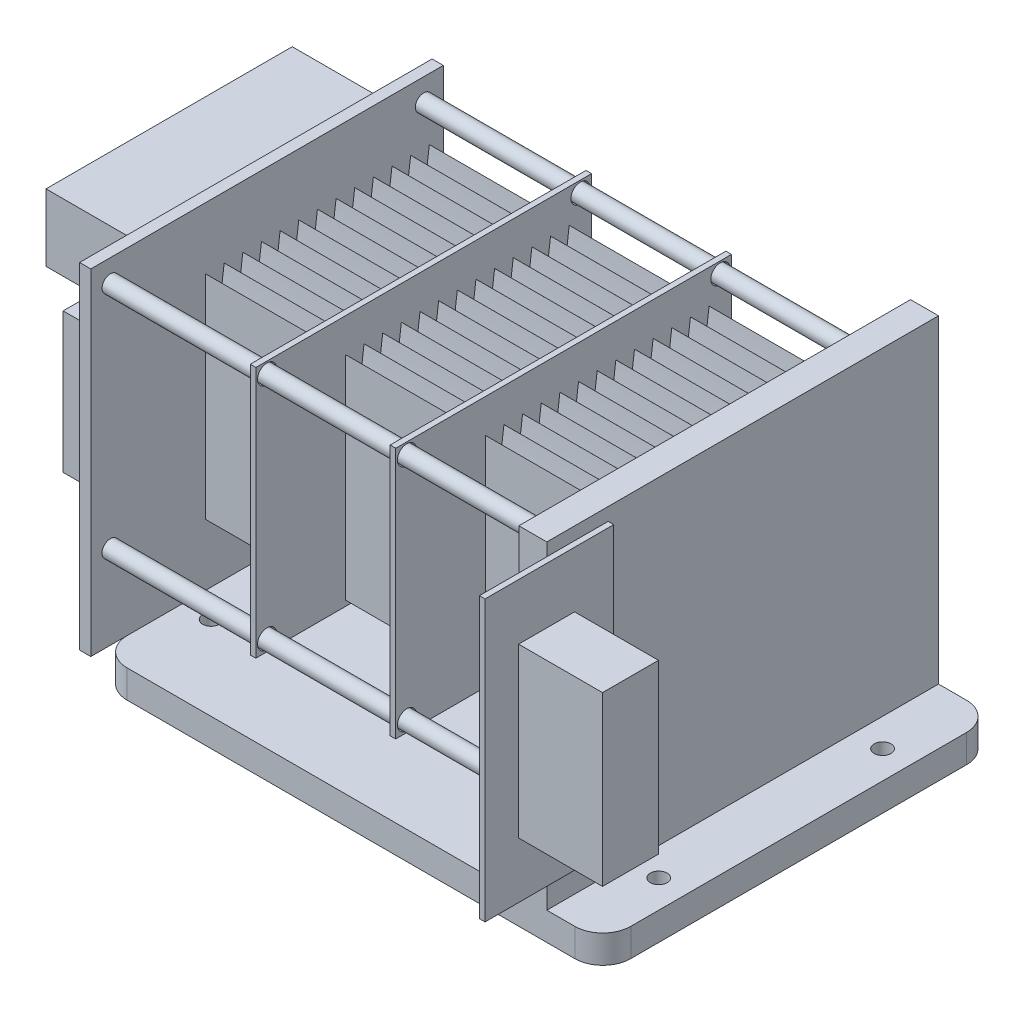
from build123d import *

# Parameters (mm, degrees)
BOSS_EXTRUDE1_DEPTH     = 5
SKETCH2_W               = 5
SKETCH2_H               = 70
BOSS_EXTRUDE2_DEPTH     = 57
SKETCH3_W               = 63
SKETCH3_H               = 60
BOSS_EXTRUDE3_DEPTH     = 2
SKETCH4_W               = 60
SKETCH4_H               = 45
SKETCH4_R               = 1.700668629
BOSS_EXTRUDE4_DEPTH     = 1
SKETCH6_W               = 40
SKETCH6_H               = 30
BOSS_EXTRUDE5_DEPTH     = 18
BOSS_EXTRUDE6_DEPTH     = 18
LPATTERN2_COUNT         = 3
LPATTERN2_PITCH         = 25
SKETCH9_R               = 1.5
BOSS_EXTRUDE7_DEPTH     = 80
SKETCH10_W              = 44.003299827
SKETCH10_H              = 12
SKETCH10_W_2            = 10
SKETCH10_H_2            = 10
SKETCH10_W_3            = 15
SKETCH10_H_3            = 20
BOSS_EXTRUDE9_DEPTH     = 15
SKETCH15_W              = 15
SKETCH15_H              = 25
SKETCH15_W_2            = 45
SKETCH15_H_2            = 20
BOSS_EXTRUDE10_DEPTH    = 7
SKETCH16_W              = 5
SKETCH16_H              = 15
BOSS_EXTRUDE11_DEPTH    = 15
SKETCH17_W              = 23
SKETCH17_H              = 50
BOSS_EXTRUDE12_DEPTH    = 1
SKETCH18_W              = 10
SKETCH18_H              = 30
BOSS_EXTRUDE13_DEPTH    = 15
SKETCH19_R              = 1.5
CUT_EXTRUDE1_DEPTH      = 100.755702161
MIRROR2_COPY_1_SKETCH_R = 1.5
MIRROR2_COPY_1_DEPTH    = 100.755702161


with BuildPart() as part:
    # Sketch1 → Boss-Extrude1 (new body)
    with BuildSketch(Plane(origin=(0, 0, 0), x_dir=(1, 0, 0), z_dir=(0, 1, 0))):
        with BuildLine():
            Line((-40, -35), (40, -35))
            ThreePointArc((40, -35), (43.535533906, -33.535533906), (45, -30))
            Line((45, -30), (45, 30))
            ThreePointArc((45, 30), (43.535533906, 33.535533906), (40, 35))
            Line((40, 35), (-40, 35))
            ThreePointArc((-40, 35), (-43.535533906, 33.535533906), (-45, 30))
            Line((-45, 30), (-45, -30))
            ThreePointArc((-45, -30), (-43.535533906, -33.535533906), (-40, -35))
        make_face()
    extrude(amount=BOSS_EXTRUDE1_DEPTH)

    # Sketch2 → Boss-Extrude2 (add)
    with BuildSketch(Plane(origin=(0, 5, 0), x_dir=(1, 0, 0), z_dir=(0, 1, 0))):
        with Locations((32.5, 0)):
            Rectangle(SKETCH2_W, SKETCH2_H)
    extrude(amount=BOSS_EXTRUDE2_DEPTH)



with BuildPart() as body_2:
    # Sketch3 → Boss-Extrude3 (new body)
    with BuildSketch(Plane.ZY.offset(50)):
        with Locations((0, 30)):
            Rectangle(SKETCH3_W, SKETCH3_H)
    extrude(amount=BOSS_EXTRUDE3_DEPTH)


with BuildPart() as body_3:
    # Sketch4 → Boss-Extrude4 (new body)
    with BuildSketch(Plane.ZY.offset(-28)):
        with Locations((0, 35.5)):
            Rectangle(SKETCH4_W, SKETCH4_H)
        with Locations((-28, 56)):
            Circle(SKETCH4_R, mode=Mode.SUBTRACT)
        with Locations((-28, 15)):
            Circle(SKETCH4_R, mode=Mode.SUBTRACT)
        with Locations((28, 56)):
            Circle(SKETCH4_R, mode=Mode.SUBTRACT)
        with Locations((28, 15)):
            Circle(SKETCH4_R, mode=Mode.SUBTRACT)
    extrude(amount=BOSS_EXTRUDE4_DEPTH)

    # Sketch6 → Boss-Extrude5 (add)
    with BuildSketch(Plane.ZY.offset(-27)):
        with Locations((0, 35)):
            Rectangle(SKETCH6_W, SKETCH6_H)
    extrude(amount=BOSS_EXTRUDE5_DEPTH)

    # Sketch8 → Boss-Extrude6 (add)
    with BuildSketch(Plane.ZY.offset(-27)):
        with BuildLine():
            Line((-20, 58), (-20, 50))
            Line((-20, 50), (-18.333083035, 50))
            add(Edge.make_bspline(
                [(-20, 58), (-19.165583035, 49.99999998), (-18.333083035, 49.99999998)],
                knots=[0, 0, 0, 0.5, 0.5, 0.5], degree=2))
        make_face()
        with BuildLine():
            add(Edge.make_bspline(
                [(-18.333083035, 49.99999998), (-17.500583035, 49.99999998), (-16.67, 58)],
                knots=[0.5, 0.5, 0.5, 1, 1, 1], degree=2))
            Line((-18.333083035, 50), (-15.000083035, 50))
            add(Edge.make_bspline(
                [(-16.667, 58), (-15.832583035, 49.99999998), (-15.000083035, 49.99999998)],
                knots=[0, 0, 0, 0.5, 0.5, 0.5], degree=2))
            Line((-16.667, 58), (-16.67, 58))
        make_face()
        with BuildLine():
            add(Edge.make_bspline(
                [(-15.000083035, 49.99999998), (-14.167583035, 49.99999998), (-13.337, 58)],
                knots=[0.5, 0.5, 0.5, 1, 1, 1], degree=2))
            Line((-15.000083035, 50), (-11.667083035, 50))
            add(Edge.make_bspline(
                [(-13.334, 58), (-12.499583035, 49.99999998), (-11.667083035, 49.99999998)],
                knots=[0, 0, 0, 0.5, 0.5, 0.5], degree=2))
            Line((-13.334, 58), (-13.337, 58))
        make_face()
        with BuildLine():
            add(Edge.make_bspline(
                [(-11.667083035, 49.99999998), (-10.834583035, 49.99999998), (-10.004, 58)],
                knots=[0.5, 0.5, 0.5, 1, 1, 1], degree=2))
            Line((-11.667083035, 50), (-8.334083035, 50))
            add(Edge.make_bspline(
                [(-10.001, 58), (-9.166583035, 49.99999998), (-8.334083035, 49.99999998)],
                knots=[0, 0, 0, 0.5, 0.5, 0.5], degree=2))
            Line((-10.001, 58), (-10.004, 58))
        make_face()
        with BuildLine():
            add(Edge.make_bspline(
                [(-8.334083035, 49.99999998), (-7.501583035, 49.99999998), (-6.671, 58)],
                knots=[0.5, 0.5, 0.5, 1, 1, 1], degree=2))
            Line((-8.334083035, 50), (-5.001083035, 50))
            add(Edge.make_bspline(
                [(-6.668, 58), (-5.833583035, 49.99999998), (-5.001083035, 49.99999998)],
                knots=[0, 0, 0, 0.5, 0.5, 0.5], degree=2))
            Line((-6.668, 58), (-6.671, 58))
        make_face()
        with BuildLine():
            add(Edge.make_bspline(
                [(-5.001083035, 49.99999998), (-4.168583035, 49.99999998), (-3.338, 58)],
                knots=[0.5, 0.5, 0.5, 1, 1, 1], degree=2))
            Line((-5.001083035, 50), (-1.668083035, 50))
            add(Edge.make_bspline(
                [(-3.335, 58), (-2.500583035, 49.99999998), (-1.668083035, 49.99999998)],
                knots=[0, 0, 0, 0.5, 0.5, 0.5], degree=2))
            Line((-3.335, 58), (-3.338, 58))
        make_face()
        with BuildLine():
            add(Edge.make_bspline(
                [(-1.668083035, 49.99999998), (-0.835583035, 49.99999998), (-0.005, 58)],
                knots=[0.5, 0.5, 0.5, 1, 1, 1], degree=2))
            Line((-1.668083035, 50), (1.664916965, 50))
            add(Edge.make_bspline(
                [(-0.002, 58), (0.832416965, 49.99999998), (1.664916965, 49.99999998)],
                knots=[0, 0, 0, 0.5, 0.5, 0.5], degree=2))
            Line((-0.002, 58), (-0.005, 58))
        make_face()
        with BuildLine():
            add(Edge.make_bspline(
                [(1.664916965, 49.99999998), (2.497416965, 49.99999998), (3.328, 58)],
                knots=[0.5, 0.5, 0.5, 1, 1, 1], degree=2))
            Line((1.664916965, 50), (4.997916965, 50))
            add(Edge.make_bspline(
                [(3.331, 58), (4.165416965, 49.99999998), (4.997916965, 49.99999998)],
                knots=[0, 0, 0, 0.5, 0.5, 0.5], degree=2))
            Line((3.331, 58), (3.328, 58))
        make_face()
        with BuildLine():
            add(Edge.make_bspline(
                [(4.997916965, 49.99999998), (5.830416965, 49.99999998), (6.661, 58)],
                knots=[0.5, 0.5, 0.5, 1, 1, 1], degree=2))
            Line((4.997916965, 50), (8.330916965, 50))
            add(Edge.make_bspline(
                [(6.664, 58), (7.498416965, 49.99999998), (8.330916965, 49.99999998)],
                knots=[0, 0, 0, 0.5, 0.5, 0.5], degree=2))
            Line((6.664, 58), (6.661, 58))
        make_face()
        with BuildLine():
            add(Edge.make_bspline(
                [(8.330916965, 49.99999998), (9.163416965, 49.99999998), (9.994, 58)],
                knots=[0.5, 0.5, 0.5, 1, 1, 1], degree=2))
            Line((8.330916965, 50), (11.663916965, 50))
            add(Edge.make_bspline(
                [(9.997, 58), (10.831416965, 49.99999998), (11.663916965, 49.99999998)],
                knots=[0, 0, 0, 0.5, 0.5, 0.5], degree=2))
            Line((9.997, 58), (9.994, 58))
        make_face()
        with BuildLine():
            add(Edge.make_bspline(
                [(11.663916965, 49.99999998), (12.496416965, 49.99999998), (13.327, 58)],
                knots=[0.5, 0.5, 0.5, 1, 1, 1], degree=2))
            Line((11.663916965, 50), (14.996916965, 50))
            add(Edge.make_bspline(
                [(13.33, 58), (14.164416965, 49.99999998), (14.996916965, 49.99999998)],
                knots=[0, 0, 0, 0.5, 0.5, 0.5], degree=2))
            Line((13.33, 58), (13.327, 58))
        make_face()
        with BuildLine():
            add(Edge.make_bspline(
                [(14.996916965, 49.99999998), (15.829416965, 49.99999998), (16.66, 58)],
                knots=[0.5, 0.5, 0.5, 1, 1, 1], degree=2))
            Line((14.996916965, 50), (18.330062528, 50))
            add(Edge.make_bspline(
                [(16.663, 58), (17.495812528, 49.999999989), (18.330062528, 49.999999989)],
                knots=[0, 0, 0, 0.5, 0.5, 0.5], degree=2))
            Line((16.663, 58), (16.66, 58))
        make_face()
        with BuildLine():
            add(Edge.make_bspline(
                [(18.330062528, 49.999999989), (19.164312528, 49.999999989), (20, 58)],
                knots=[0.5, 0.5, 0.5, 1, 1, 1], degree=2))
            Line((18.330062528, 50), (20, 50))
            Line((20, 50), (20, 58))
        make_face()
    extrude(amount=BOSS_EXTRUDE6_DEPTH)


with BuildPart() as lpattern2_1:
    # LPattern2: pattern copy
    add(body_3.part.moved(Location(Vector(-1, 0, 0) * (1 * LPATTERN2_PITCH))))


with BuildPart() as lpattern2_2:
    # LPattern2: pattern copy
    add(body_3.part.moved(Location(Vector(-1, 0, 0) * (2 * LPATTERN2_PITCH))))


with BuildPart() as part_1:
    add(part.part)

    add(body_2.part)  # Boss-Extrude7 merges body 2
    # Sketch9 → Boss-Extrude7 (add)
    with BuildSketch(Plane.ZY.offset(-30)):
        with Locations(Location((28, 56, 0), (0, 0, 180))):
            Circle(SKETCH9_R)
        with Locations(Location((-28, 56, 0), (0, 0, 180))):
            Circle(SKETCH9_R)
        with Locations(Location((-28, 15, 0), (0, 0, 180))):
            Circle(SKETCH9_R)
        with Locations(Location((28, 15, 0), (0, 0, 180))):
            Circle(SKETCH9_R)
    extrude(amount=BOSS_EXTRUDE7_DEPTH)

    # Sketch10 → Boss-Extrude9 (add)
    with BuildSketch(Plane.ZY.offset(52)):
        with Locations((0.501649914, 53.394885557)):
            Rectangle(SKETCH10_W, SKETCH10_H)
        with Locations((-25.857810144, 40.221764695)):
            Rectangle(SKETCH10_W_2, SKETCH10_H_2)
        with Locations((-12.661997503, 36.913108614)):
            Rectangle(SKETCH10_W_3, SKETCH10_H_3)
        with Locations((3.867207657, 36.822288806)):
            Rectangle(SKETCH10_W_3, SKETCH10_H_3)
    extrude(amount=BOSS_EXTRUDE9_DEPTH)

    # Sketch15 → Boss-Extrude10 (add)
    with BuildSketch(Plane.ZY.offset(52)):
        with Locations((19.947224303, 34.484286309)):
            Rectangle(SKETCH15_W, SKETCH15_H)
        with Locations((1.248164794, 11.373100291)):
            Rectangle(SKETCH15_W_2, SKETCH15_H_2)
    extrude(amount=BOSS_EXTRUDE10_DEPTH)

    # Sketch16 → Boss-Extrude11 (add)
    with BuildSketch(Plane.ZY.offset(52)):
        with Locations((-26.289879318, 22.682621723)):
            Rectangle(SKETCH16_W, SKETCH16_H)
    extrude(amount=BOSS_EXTRUDE11_DEPTH)

    # Sketch17 → Boss-Extrude12 (add)
    with BuildSketch(Plane(origin=(35, 0, 0), x_dir=(0, 0, -1), z_dir=(1, 0, 0))):
        with Locations((-35.544660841, 34.699059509)):
            Rectangle(SKETCH17_W, SKETCH17_H)
    extrude(amount=BOSS_EXTRUDE12_DEPTH)

    # Sketch18 → Boss-Extrude13 (add)
    with BuildSketch(Plane(origin=(36, 0, 0), x_dir=(0, 0, -1), z_dir=(1, 0, 0))):
        with Locations((-36.044660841, 34.699059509)):
            Rectangle(SKETCH18_W, SKETCH18_H)
    extrude(amount=BOSS_EXTRUDE13_DEPTH)

    # Sketch19 → Cut-Extrude1 (cut, through all)
    with BuildSketch(Plane(origin=(0, 5, 0), x_dir=(1, 0, 0), z_dir=(0, 1, 0))):
        with Locations(Location((40, 20, 0), (0, 0, 270))):
            Circle(SKETCH19_R)
    cut_extrude1 = extrude(amount=-CUT_EXTRUDE1_DEPTH, mode=Mode.SUBTRACT)

    # Mirror1: Cut-Extrude1 across plane
    add(cut_extrude1.mirror(Plane.XY), mode=Mode.SUBTRACT)

    # Mirror2: Cut-Extrude1 across plane
    add(cut_extrude1.mirror(Plane(origin=(0, 0, 0), x_dir=(0, 0, 1), z_dir=(1, 0, 0))), mode=Mode.SUBTRACT)

    # Mirror2 copy 1 sketch → Mirror2 copy 1 (cut, through all)
    with BuildSketch(Plane(origin=(0, 5, 0), x_dir=(-1, 0, 0), z_dir=(0, 1, 0))):
        with Locations(Location((40, 20, 0), (0, 0, 270))):
            Circle(MIRROR2_COPY_1_SKETCH_R)
    extrude(amount=-MIRROR2_COPY_1_DEPTH, mode=Mode.SUBTRACT)


solid = Compound([body_3.part, lpattern2_1.part, lpattern2_2.part, part_1.part])
